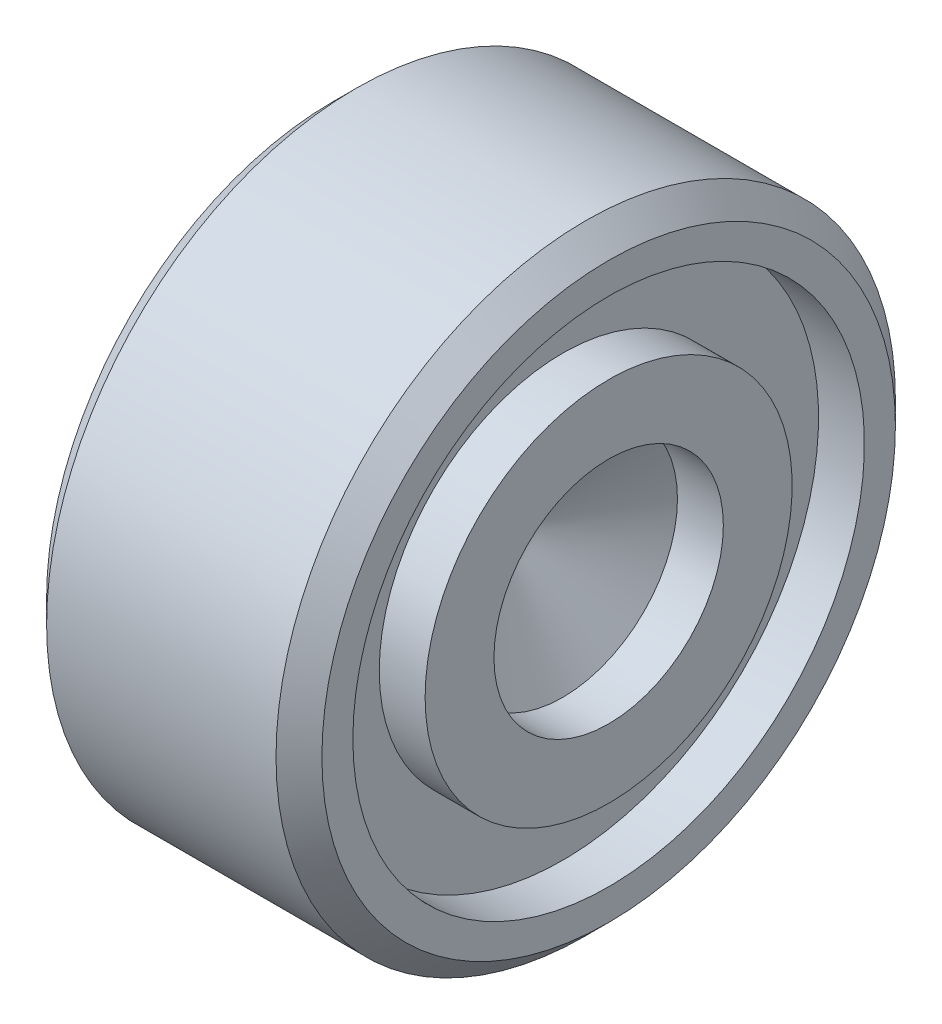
ISO-10303-21;
HEADER;
FILE_DESCRIPTION(('STEP AP214'),'2;1');
FILE_NAME('part.step','',(''),(''),'','','');
FILE_SCHEMA(('AUTOMOTIVE_DESIGN { 1 0 10303 214 1 1 1 1 }'));
ENDSEC;
DATA;
#1=APPLICATION_CONTEXT('core data for automotive mechanical design processes');
#2=APPLICATION_PROTOCOL_DEFINITION('international standard','automotive_design',2000,#1);
#3=PRODUCT_CONTEXT('',#1,'mechanical');
#4=PRODUCT('Part','Part','',(#3));
#5=PRODUCT_RELATED_PRODUCT_CATEGORY('part','',(#4));
#6=PRODUCT_DEFINITION_FORMATION('','',#4);
#7=PRODUCT_DEFINITION_CONTEXT('part definition',#1,'design');
#8=PRODUCT_DEFINITION('design','',#6,#7);
#9=PRODUCT_DEFINITION_SHAPE('','',#8);
#10=(LENGTH_UNIT() NAMED_UNIT(*) SI_UNIT(.MILLI.,.METRE.));
#11=(NAMED_UNIT(*) PLANE_ANGLE_UNIT() SI_UNIT($,.RADIAN.));
#12=(NAMED_UNIT(*) SI_UNIT($,.STERADIAN.) SOLID_ANGLE_UNIT());
#13=UNCERTAINTY_MEASURE_WITH_UNIT(LENGTH_MEASURE(1.E-05),#10,'distance_accuracy_value','');
#14=(GEOMETRIC_REPRESENTATION_CONTEXT(3) GLOBAL_UNCERTAINTY_ASSIGNED_CONTEXT((#13)) GLOBAL_UNIT_ASSIGNED_CONTEXT((#10,
#11,#12)) REPRESENTATION_CONTEXT('',''));
#15=CARTESIAN_POINT('',(0.,0.,0.));
#16=DIRECTION('',(0.,0.,1.));
#17=DIRECTION('',(1.,0.,0.));
#18=AXIS2_PLACEMENT_3D('',#15,#16,#17);
#19=CARTESIAN_POINT('',(0.,0.,0.));
#20=DIRECTION('',(1.,0.,0.));
#21=DIRECTION('',(0.,0.,-1.));
#22=AXIS2_PLACEMENT_3D('',#19,#20,#21);
#23=PLANE('',#22);
#24=CARTESIAN_POINT('',(0.,0.,0.));
#25=DIRECTION('',(1.,0.,0.));
#26=DIRECTION('',(0.,0.,-1.));
#27=AXIS2_PLACEMENT_3D('',#24,#25,#26);
#28=CIRCLE('',#27,12.5);
#29=CARTESIAN_POINT('',(0.,0.,-12.5));
#30=VERTEX_POINT('',#29);
#31=EDGE_CURVE('E87',#30,#30,#28,.F.);
#32=ORIENTED_EDGE('',*,*,#31,.T.);
#33=EDGE_LOOP('',(#32));
#34=FACE_BOUND('',#33,.T.);
#35=CARTESIAN_POINT('',(0.,-9.,0.));
#36=DIRECTION('',(-1.,0.,0.));
#37=DIRECTION('',(0.,0.,-1.));
#38=AXIS2_PLACEMENT_3D('',#35,#36,#37);
#39=CIRCLE('',#38,2.);
#40=CARTESIAN_POINT('',(0.,-8.99999999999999,-2.00000000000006));
#41=VERTEX_POINT('',#40);
#42=EDGE_CURVE('E91',#41,#41,#39,.T.);
#43=ORIENTED_EDGE('',*,*,#42,.F.);
#44=EDGE_LOOP('',(#43));
#45=FACE_BOUND('',#44,.T.);
#46=CARTESIAN_POINT('',(0.,9.,0.));
#47=DIRECTION('',(-1.,0.,0.));
#48=DIRECTION('',(0.,0.,1.));
#49=AXIS2_PLACEMENT_3D('',#46,#47,#48);
#50=CIRCLE('',#49,2.);
#51=CARTESIAN_POINT('',(0.,9.,2.));
#52=VERTEX_POINT('',#51);
#53=EDGE_CURVE('E95',#52,#52,#50,.T.);
#54=ORIENTED_EDGE('',*,*,#53,.F.);
#55=EDGE_LOOP('',(#54));
#56=FACE_BOUND('',#55,.T.);
#57=CARTESIAN_POINT('',(0.,0.,9.));
#58=DIRECTION('',(-1.,0.,0.));
#59=DIRECTION('',(0.,-1.,0.));
#60=AXIS2_PLACEMENT_3D('',#57,#58,#59);
#61=CIRCLE('',#60,2.);
#62=CARTESIAN_POINT('',(0.,-2.00000000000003,8.99999999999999));
#63=VERTEX_POINT('',#62);
#64=EDGE_CURVE('E99',#63,#63,#61,.T.);
#65=ORIENTED_EDGE('',*,*,#64,.F.);
#66=EDGE_LOOP('',(#65));
#67=FACE_BOUND('',#66,.T.);
#68=CARTESIAN_POINT('',(0.,0.,-9.));
#69=DIRECTION('',(-1.,0.,0.));
#70=DIRECTION('',(0.,1.,0.));
#71=AXIS2_PLACEMENT_3D('',#68,#69,#70);
#72=CIRCLE('',#71,2.);
#73=CARTESIAN_POINT('',(0.,2.00000000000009,-8.99999999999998));
#74=VERTEX_POINT('',#73);
#75=EDGE_CURVE('E102',#74,#74,#72,.T.);
#76=ORIENTED_EDGE('',*,*,#75,.F.);
#77=EDGE_LOOP('',(#76));
#78=FACE_BOUND('',#77,.T.);
#79=ADVANCED_FACE('F36',(#34,#45,#56,#67,#78),#23,.F.);
#80=CARTESIAN_POINT('',(0.,0.,0.));
#81=DIRECTION('',(-1.,0.,0.));
#82=DIRECTION('',(0.,0.,1.));
#83=AXIS2_PLACEMENT_3D('',#80,#81,#82);
#84=CYLINDRICAL_SURFACE('',#83,13.5);
#85=CARTESIAN_POINT('',(1.,0.,0.));
#86=DIRECTION('',(1.,0.,0.));
#87=DIRECTION('',(0.,0.,-1.));
#88=AXIS2_PLACEMENT_3D('',#85,#86,#87);
#89=CIRCLE('',#88,13.5);
#90=CARTESIAN_POINT('',(1.,0.,-13.5));
#91=VERTEX_POINT('',#90);
#92=EDGE_CURVE('E43',#91,#91,#89,.T.);
#93=ORIENTED_EDGE('',*,*,#92,.T.);
#94=EDGE_LOOP('',(#93));
#95=FACE_BOUND('',#94,.T.);
#96=CARTESIAN_POINT('',(11.,0.,0.));
#97=DIRECTION('',(-1.,0.,0.));
#98=DIRECTION('',(0.,0.,1.));
#99=AXIS2_PLACEMENT_3D('',#96,#97,#98);
#100=CIRCLE('',#99,13.5);
#101=CARTESIAN_POINT('',(11.,0.,13.5));
#102=VERTEX_POINT('',#101);
#103=EDGE_CURVE('E138',#102,#102,#100,.T.);
#104=ORIENTED_EDGE('',*,*,#103,.T.);
#105=EDGE_LOOP('',(#104));
#106=FACE_BOUND('',#105,.T.);
#107=ADVANCED_FACE('F77',(#95,#106),#84,.T.);
#108=CARTESIAN_POINT('',(12.,13.5,0.));
#109=DIRECTION('',(-1.,0.,0.));
#110=DIRECTION('',(0.,0.,1.));
#111=AXIS2_PLACEMENT_3D('',#108,#109,#110);
#112=PLANE('',#111);
#113=CARTESIAN_POINT('',(12.,0.,0.));
#114=DIRECTION('',(-1.,0.,0.));
#115=DIRECTION('',(0.,0.,1.));
#116=AXIS2_PLACEMENT_3D('',#113,#114,#115);
#117=CIRCLE('',#116,12.5);
#118=CARTESIAN_POINT('',(12.,0.,12.5));
#119=VERTEX_POINT('',#118);
#120=EDGE_CURVE('E13',#119,#119,#117,.F.);
#121=ORIENTED_EDGE('',*,*,#120,.T.);
#122=EDGE_LOOP('',(#121));
#123=FACE_BOUND('',#122,.T.);
#124=CARTESIAN_POINT('',(12.,0.,0.));
#125=DIRECTION('',(-1.,0.,0.));
#126=DIRECTION('',(0.,0.,1.));
#127=AXIS2_PLACEMENT_3D('',#124,#125,#126);
#128=CIRCLE('',#127,11.15);
#129=CARTESIAN_POINT('',(12.,0.,11.15));
#130=VERTEX_POINT('',#129);
#131=EDGE_CURVE('E134',#130,#130,#128,.T.);
#132=ORIENTED_EDGE('',*,*,#131,.T.);
#133=EDGE_LOOP('',(#132));
#134=FACE_BOUND('',#133,.T.);
#135=ADVANCED_FACE('F82',(#123,#134),#112,.F.);
#136=CARTESIAN_POINT('',(0.,0.,0.));
#137=DIRECTION('',(-1.,0.,0.));
#138=DIRECTION('',(0.,0.,1.));
#139=AXIS2_PLACEMENT_3D('',#136,#137,#138);
#140=CYLINDRICAL_SURFACE('',#139,11.15);
#141=ORIENTED_EDGE('',*,*,#131,.F.);
#142=EDGE_LOOP('',(#141));
#143=FACE_BOUND('',#142,.T.);
#144=CARTESIAN_POINT('',(10.,0.,0.));
#145=DIRECTION('',(-1.,0.,0.));
#146=DIRECTION('',(0.,0.,1.));
#147=AXIS2_PLACEMENT_3D('',#144,#145,#146);
#148=CIRCLE('',#147,11.15);
#149=CARTESIAN_POINT('',(10.,0.,11.15));
#150=VERTEX_POINT('',#149);
#151=EDGE_CURVE('E131',#150,#150,#148,.T.);
#152=ORIENTED_EDGE('',*,*,#151,.T.);
#153=EDGE_LOOP('',(#152));
#154=FACE_BOUND('',#153,.T.);
#155=ADVANCED_FACE('F161',(#143,#154),#140,.F.);
#156=CARTESIAN_POINT('',(10.,11.15,0.));
#157=DIRECTION('',(-1.,0.,0.));
#158=DIRECTION('',(0.,0.,1.));
#159=AXIS2_PLACEMENT_3D('',#156,#157,#158);
#160=PLANE('',#159);
#161=ORIENTED_EDGE('',*,*,#151,.F.);
#162=EDGE_LOOP('',(#161));
#163=FACE_BOUND('',#162,.T.);
#164=CARTESIAN_POINT('',(10.,0.,0.));
#165=DIRECTION('',(-1.,0.,0.));
#166=DIRECTION('',(0.,0.,1.));
#167=AXIS2_PLACEMENT_3D('',#164,#165,#166);
#168=CIRCLE('',#167,8.);
#169=CARTESIAN_POINT('',(10.,0.,8.));
#170=VERTEX_POINT('',#169);
#171=EDGE_CURVE('E128',#170,#170,#168,.T.);
#172=ORIENTED_EDGE('',*,*,#171,.T.);
#173=EDGE_LOOP('',(#172));
#174=FACE_BOUND('',#173,.T.);
#175=ADVANCED_FACE('F167',(#163,#174),#160,.F.);
#176=CARTESIAN_POINT('',(0.,0.,0.));
#177=DIRECTION('',(-1.,0.,0.));
#178=DIRECTION('',(0.,0.,1.));
#179=AXIS2_PLACEMENT_3D('',#176,#177,#178);
#180=CYLINDRICAL_SURFACE('',#179,8.);
#181=ORIENTED_EDGE('',*,*,#171,.F.);
#182=EDGE_LOOP('',(#181));
#183=FACE_BOUND('',#182,.T.);
#184=CARTESIAN_POINT('',(12.,0.,0.));
#185=DIRECTION('',(-1.,0.,0.));
#186=DIRECTION('',(0.,0.,1.));
#187=AXIS2_PLACEMENT_3D('',#184,#185,#186);
#188=CIRCLE('',#187,8.);
#189=CARTESIAN_POINT('',(12.,0.,8.));
#190=VERTEX_POINT('',#189);
#191=EDGE_CURVE('E125',#190,#190,#188,.T.);
#192=ORIENTED_EDGE('',*,*,#191,.T.);
#193=EDGE_LOOP('',(#192));
#194=FACE_BOUND('',#193,.T.);
#195=ADVANCED_FACE('F173',(#183,#194),#180,.T.);
#196=CARTESIAN_POINT('',(12.,8.,0.));
#197=DIRECTION('',(-1.,0.,0.));
#198=DIRECTION('',(0.,0.,1.));
#199=AXIS2_PLACEMENT_3D('',#196,#197,#198);
#200=PLANE('',#199);
#201=ORIENTED_EDGE('',*,*,#191,.F.);
#202=EDGE_LOOP('',(#201));
#203=FACE_BOUND('',#202,.T.);
#204=CARTESIAN_POINT('',(12.,0.,0.));
#205=DIRECTION('',(-1.,0.,0.));
#206=DIRECTION('',(0.,0.,1.));
#207=AXIS2_PLACEMENT_3D('',#204,#205,#206);
#208=CIRCLE('',#207,5.);
#209=CARTESIAN_POINT('',(12.,0.,5.));
#210=VERTEX_POINT('',#209);
#211=EDGE_CURVE('E122',#210,#210,#208,.T.);
#212=ORIENTED_EDGE('',*,*,#211,.T.);
#213=EDGE_LOOP('',(#212));
#214=FACE_BOUND('',#213,.T.);
#215=ADVANCED_FACE('F179',(#203,#214),#200,.F.);
#216=CARTESIAN_POINT('',(0.,0.,0.));
#217=DIRECTION('',(-1.,0.,0.));
#218=DIRECTION('',(0.,0.,1.));
#219=AXIS2_PLACEMENT_3D('',#216,#217,#218);
#220=CYLINDRICAL_SURFACE('',#219,5.);
#221=ORIENTED_EDGE('',*,*,#211,.F.);
#222=EDGE_LOOP('',(#221));
#223=FACE_BOUND('',#222,.T.);
#224=CARTESIAN_POINT('',(10.,0.,0.));
#225=DIRECTION('',(-1.,0.,0.));
#226=DIRECTION('',(0.,0.,1.));
#227=AXIS2_PLACEMENT_3D('',#224,#225,#226);
#228=CIRCLE('',#227,5.);
#229=CARTESIAN_POINT('',(10.,0.,5.));
#230=VERTEX_POINT('',#229);
#231=EDGE_CURVE('E119',#230,#230,#228,.T.);
#232=ORIENTED_EDGE('',*,*,#231,.T.);
#233=EDGE_LOOP('',(#232));
#234=FACE_BOUND('',#233,.T.);
#235=ADVANCED_FACE('F185',(#223,#234),#220,.F.);
#236=CARTESIAN_POINT('',(7.11324865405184,0.,0.));
#237=DIRECTION('',(1.,0.,0.));
#238=DIRECTION('',(0.,0.,-1.));
#239=AXIS2_PLACEMENT_3D('',#236,#237,#238);
#240=CONICAL_SURFACE('',#239,0.,1.04719755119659);
#241=ORIENTED_EDGE('',*,*,#231,.F.);
#242=EDGE_LOOP('',(#241));
#243=FACE_BOUND('',#242,.T.);
#244=CARTESIAN_POINT('',(7.11324865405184,0.,0.));
#245=VERTEX_POINT('',#244);
#246=VERTEX_LOOP('',#245);
#247=FACE_BOUND('',#246,.T.);
#248=ADVANCED_FACE('F191',(#243,#247),#240,.F.);
#249=CARTESIAN_POINT('',(5.15470053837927,9.,0.));
#250=DIRECTION('',(-1.,0.,0.));
#251=DIRECTION('',(0.,0.,1.));
#252=AXIS2_PLACEMENT_3D('',#249,#250,#251);
#253=CONICAL_SURFACE('',#252,0.,1.04719755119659);
#254=CARTESIAN_POINT('',(4.,9.,0.));
#255=DIRECTION('',(-1.,0.,0.));
#256=DIRECTION('',(0.,0.,1.));
#257=AXIS2_PLACEMENT_3D('',#254,#255,#256);
#258=CIRCLE('',#257,2.);
#259=CARTESIAN_POINT('',(4.,9.,2.));
#260=VERTEX_POINT('',#259);
#261=EDGE_CURVE('E116',#260,#260,#258,.T.);
#262=ORIENTED_EDGE('',*,*,#261,.T.);
#263=EDGE_LOOP('',(#262));
#264=FACE_BOUND('',#263,.T.);
#265=CARTESIAN_POINT('',(5.15470053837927,9.,0.));
#266=VERTEX_POINT('',#265);
#267=VERTEX_LOOP('',#266);
#268=FACE_BOUND('',#267,.T.);
#269=ADVANCED_FACE('F196',(#264,#268),#253,.F.);
#270=CARTESIAN_POINT('',(0.,9.,0.));
#271=DIRECTION('',(-1.,0.,0.));
#272=DIRECTION('',(0.,0.,1.));
#273=AXIS2_PLACEMENT_3D('',#270,#271,#272);
#274=CYLINDRICAL_SURFACE('',#273,2.);
#275=ORIENTED_EDGE('',*,*,#53,.T.);
#276=EDGE_LOOP('',(#275));
#277=FACE_BOUND('',#276,.T.);
#278=ORIENTED_EDGE('',*,*,#261,.F.);
#279=EDGE_LOOP('',(#278));
#280=FACE_BOUND('',#279,.T.);
#281=ADVANCED_FACE('F201',(#277,#280),#274,.F.);
#282=CARTESIAN_POINT('',(5.15470053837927,0.,9.));
#283=DIRECTION('',(-1.,0.,0.));
#284=DIRECTION('',(0.,-1.,0.));
#285=AXIS2_PLACEMENT_3D('',#282,#283,#284);
#286=CONICAL_SURFACE('',#285,0.,1.04719755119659);
#287=CARTESIAN_POINT('',(4.,0.,9.));
#288=DIRECTION('',(-1.,0.,0.));
#289=DIRECTION('',(0.,-1.,0.));
#290=AXIS2_PLACEMENT_3D('',#287,#288,#289);
#291=CIRCLE('',#290,2.);
#292=CARTESIAN_POINT('',(4.,-2.00000000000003,8.99999999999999));
#293=VERTEX_POINT('',#292);
#294=EDGE_CURVE('E112',#293,#293,#291,.T.);
#295=ORIENTED_EDGE('',*,*,#294,.T.);
#296=EDGE_LOOP('',(#295));
#297=FACE_BOUND('',#296,.T.);
#298=CARTESIAN_POINT('',(5.15470053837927,0.,9.));
#299=VERTEX_POINT('',#298);
#300=VERTEX_LOOP('',#299);
#301=FACE_BOUND('',#300,.T.);
#302=ADVANCED_FACE('F207',(#297,#301),#286,.F.);
#303=CARTESIAN_POINT('',(0.,0.,9.));
#304=DIRECTION('',(-1.,0.,0.));
#305=DIRECTION('',(0.,-1.,0.));
#306=AXIS2_PLACEMENT_3D('',#303,#304,#305);
#307=CYLINDRICAL_SURFACE('',#306,2.);
#308=ORIENTED_EDGE('',*,*,#64,.T.);
#309=EDGE_LOOP('',(#308));
#310=FACE_BOUND('',#309,.T.);
#311=ORIENTED_EDGE('',*,*,#294,.F.);
#312=EDGE_LOOP('',(#311));
#313=FACE_BOUND('',#312,.T.);
#314=ADVANCED_FACE('F211',(#310,#313),#307,.F.);
#315=CARTESIAN_POINT('',(5.15470053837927,-9.,0.));
#316=DIRECTION('',(-1.,0.,0.));
#317=DIRECTION('',(0.,0.,-1.));
#318=AXIS2_PLACEMENT_3D('',#315,#316,#317);
#319=CONICAL_SURFACE('',#318,0.,1.04719755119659);
#320=CARTESIAN_POINT('',(4.,-9.,0.));
#321=DIRECTION('',(-1.,0.,0.));
#322=DIRECTION('',(0.,0.,-1.));
#323=AXIS2_PLACEMENT_3D('',#320,#321,#322);
#324=CIRCLE('',#323,2.);
#325=CARTESIAN_POINT('',(4.,-8.99999999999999,-2.00000000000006));
#326=VERTEX_POINT('',#325);
#327=EDGE_CURVE('E108',#326,#326,#324,.T.);
#328=ORIENTED_EDGE('',*,*,#327,.T.);
#329=EDGE_LOOP('',(#328));
#330=FACE_BOUND('',#329,.T.);
#331=CARTESIAN_POINT('',(5.15470053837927,-9.,0.));
#332=VERTEX_POINT('',#331);
#333=VERTEX_LOOP('',#332);
#334=FACE_BOUND('',#333,.T.);
#335=ADVANCED_FACE('F72',(#330,#334),#319,.F.);
#336=CARTESIAN_POINT('',(0.,-9.,0.));
#337=DIRECTION('',(-1.,0.,0.));
#338=DIRECTION('',(0.,0.,-1.));
#339=AXIS2_PLACEMENT_3D('',#336,#337,#338);
#340=CYLINDRICAL_SURFACE('',#339,2.);
#341=ORIENTED_EDGE('',*,*,#42,.T.);
#342=EDGE_LOOP('',(#341));
#343=FACE_BOUND('',#342,.T.);
#344=ORIENTED_EDGE('',*,*,#327,.F.);
#345=EDGE_LOOP('',(#344));
#346=FACE_BOUND('',#345,.T.);
#347=ADVANCED_FACE('F62',(#343,#346),#340,.F.);
#348=CARTESIAN_POINT('',(5.15470053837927,0.,-9.));
#349=DIRECTION('',(-1.,0.,0.));
#350=DIRECTION('',(0.,1.,0.));
#351=AXIS2_PLACEMENT_3D('',#348,#349,#350);
#352=CONICAL_SURFACE('',#351,0.,1.04719755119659);
#353=CARTESIAN_POINT('',(4.,0.,-9.));
#354=DIRECTION('',(-1.,0.,0.));
#355=DIRECTION('',(0.,1.,0.));
#356=AXIS2_PLACEMENT_3D('',#353,#354,#355);
#357=CIRCLE('',#356,2.);
#358=CARTESIAN_POINT('',(4.,2.00000000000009,-8.99999999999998));
#359=VERTEX_POINT('',#358);
#360=EDGE_CURVE('E103',#359,#359,#357,.T.);
#361=ORIENTED_EDGE('',*,*,#360,.T.);
#362=EDGE_LOOP('',(#361));
#363=FACE_BOUND('',#362,.T.);
#364=CARTESIAN_POINT('',(5.15470053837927,0.,-9.));
#365=VERTEX_POINT('',#364);
#366=VERTEX_LOOP('',#365);
#367=FACE_BOUND('',#366,.T.);
#368=ADVANCED_FACE('F59',(#363,#367),#352,.F.);
#369=CARTESIAN_POINT('',(0.,0.,-9.));
#370=DIRECTION('',(-1.,0.,0.));
#371=DIRECTION('',(0.,1.,0.));
#372=AXIS2_PLACEMENT_3D('',#369,#370,#371);
#373=CYLINDRICAL_SURFACE('',#372,2.);
#374=ORIENTED_EDGE('',*,*,#75,.T.);
#375=EDGE_LOOP('',(#374));
#376=FACE_BOUND('',#375,.T.);
#377=ORIENTED_EDGE('',*,*,#360,.F.);
#378=EDGE_LOOP('',(#377));
#379=FACE_BOUND('',#378,.T.);
#380=ADVANCED_FACE('F61',(#376,#379),#373,.F.);
#381=CARTESIAN_POINT('',(0.,0.,0.));
#382=DIRECTION('',(1.,0.,0.));
#383=DIRECTION('',(0.,0.,-1.));
#384=AXIS2_PLACEMENT_3D('',#381,#382,#383);
#385=CONICAL_SURFACE('',#384,12.5,0.785398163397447);
#386=ORIENTED_EDGE('',*,*,#92,.F.);
#387=EDGE_LOOP('',(#386));
#388=FACE_BOUND('',#387,.T.);
#389=ORIENTED_EDGE('',*,*,#31,.F.);
#390=EDGE_LOOP('',(#389));
#391=FACE_BOUND('',#390,.T.);
#392=ADVANCED_FACE('F69',(#388,#391),#385,.T.);
#393=CARTESIAN_POINT('',(11.,0.,0.));
#394=DIRECTION('',(-1.,0.,0.));
#395=DIRECTION('',(0.,0.,1.));
#396=AXIS2_PLACEMENT_3D('',#393,#394,#395);
#397=CONICAL_SURFACE('',#396,13.5,0.78539816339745);
#398=ORIENTED_EDGE('',*,*,#120,.F.);
#399=EDGE_LOOP('',(#398));
#400=FACE_BOUND('',#399,.T.);
#401=ORIENTED_EDGE('',*,*,#103,.F.);
#402=EDGE_LOOP('',(#401));
#403=FACE_BOUND('',#402,.T.);
#404=ADVANCED_FACE('F146',(#400,#403),#397,.T.);
#405=CLOSED_SHELL('',(#79,#107,#135,#155,#175,#195,#215,#235,#248,#269,#281,#302,#314,#335,#347,
#368,#380,#392,#404));
#406=MANIFOLD_SOLID_BREP('B2',#405);
#407=ADVANCED_BREP_SHAPE_REPRESENTATION('',(#18,#406),#14);
#408=SHAPE_DEFINITION_REPRESENTATION(#9,#407);
ENDSEC;
END-ISO-10303-21;
